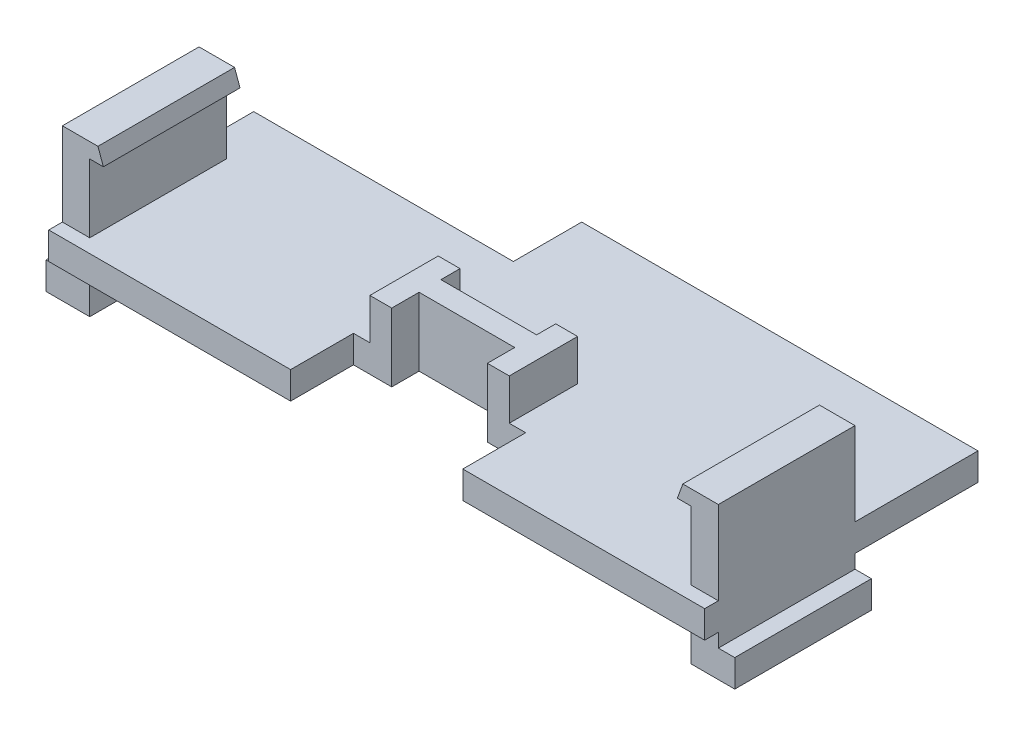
ISO-10303-21;
HEADER;
FILE_DESCRIPTION(('STEP AP214'),'2;1');
FILE_NAME('part.step','',(''),(''),'','','');
FILE_SCHEMA(('AUTOMOTIVE_DESIGN { 1 0 10303 214 1 1 1 1 }'));
ENDSEC;
DATA;
#1=APPLICATION_CONTEXT('core data for automotive mechanical design processes');
#2=APPLICATION_PROTOCOL_DEFINITION('international standard','automotive_design',2000,#1);
#3=PRODUCT_CONTEXT('',#1,'mechanical');
#4=PRODUCT('Part','Part','',(#3));
#5=PRODUCT_RELATED_PRODUCT_CATEGORY('part','',(#4));
#6=PRODUCT_DEFINITION_FORMATION('','',#4);
#7=PRODUCT_DEFINITION_CONTEXT('part definition',#1,'design');
#8=PRODUCT_DEFINITION('design','',#6,#7);
#9=PRODUCT_DEFINITION_SHAPE('','',#8);
#10=(LENGTH_UNIT() NAMED_UNIT(*) SI_UNIT(.MILLI.,.METRE.));
#11=(NAMED_UNIT(*) PLANE_ANGLE_UNIT() SI_UNIT($,.RADIAN.));
#12=(NAMED_UNIT(*) SI_UNIT($,.STERADIAN.) SOLID_ANGLE_UNIT());
#13=UNCERTAINTY_MEASURE_WITH_UNIT(LENGTH_MEASURE(1.E-05),#10,'distance_accuracy_value','');
#14=(GEOMETRIC_REPRESENTATION_CONTEXT(3) GLOBAL_UNCERTAINTY_ASSIGNED_CONTEXT((#13)) GLOBAL_UNIT_ASSIGNED_CONTEXT((#10,
#11,#12)) REPRESENTATION_CONTEXT('',''));
#15=CARTESIAN_POINT('',(0.,0.,0.));
#16=DIRECTION('',(0.,0.,1.));
#17=DIRECTION('',(1.,0.,0.));
#18=AXIS2_PLACEMENT_3D('',#15,#16,#17);
#19=CARTESIAN_POINT('',(0.,0.,0.));
#20=DIRECTION('',(0.,1.,0.));
#21=DIRECTION('',(0.,0.,1.));
#22=AXIS2_PLACEMENT_3D('',#19,#20,#21);
#23=PLANE('',#22);
#24=DIRECTION('',(-1.,0.,0.));
#25=VECTOR('',#24,1.);
#26=CARTESIAN_POINT('',(-11.,0.,-4.5));
#27=LINE('',#26,#25);
#28=CARTESIAN_POINT('',(-11.,0.,-4.5));
#29=VERTEX_POINT('',#28);
#30=CARTESIAN_POINT('',(-12.,0.,-4.5));
#31=VERTEX_POINT('',#30);
#32=EDGE_CURVE('E402',#29,#31,#27,.T.);
#33=ORIENTED_EDGE('',*,*,#32,.T.);
#34=DIRECTION('',(0.,0.,1.));
#35=VECTOR('',#34,1.);
#36=CARTESIAN_POINT('',(-12.,0.,-9.));
#37=LINE('',#36,#35);
#38=CARTESIAN_POINT('',(-12.,0.,-6.5));
#39=VERTEX_POINT('',#38);
#40=EDGE_CURVE('E677',#39,#31,#37,.T.);
#41=ORIENTED_EDGE('',*,*,#40,.F.);
#42=DIRECTION('',(-1.,0.,0.));
#43=VECTOR('',#42,1.);
#44=CARTESIAN_POINT('',(-12.,0.,-6.5));
#45=LINE('',#44,#43);
#46=CARTESIAN_POINT('',(-2.5,0.,-6.5));
#47=VERTEX_POINT('',#46);
#48=EDGE_CURVE('E605',#47,#39,#45,.T.);
#49=ORIENTED_EDGE('',*,*,#48,.F.);
#50=DIRECTION('',(0.,0.,1.));
#51=VECTOR('',#50,1.);
#52=CARTESIAN_POINT('',(-2.5,0.,-9.));
#53=LINE('',#52,#51);
#54=CARTESIAN_POINT('',(-2.5,0.,-9.));
#55=VERTEX_POINT('',#54);
#56=EDGE_CURVE('E593',#55,#47,#53,.T.);
#57=ORIENTED_EDGE('',*,*,#56,.F.);
#58=DIRECTION('',(-1.,0.,0.));
#59=VECTOR('',#58,1.);
#60=CARTESIAN_POINT('',(-12.,0.,-9.));
#61=LINE('',#60,#59);
#62=CARTESIAN_POINT('',(12.,0.,-9.));
#63=VERTEX_POINT('',#62);
#64=EDGE_CURVE('E673',#63,#55,#61,.T.);
#65=ORIENTED_EDGE('',*,*,#64,.F.);
#66=DIRECTION('',(0.,0.,-1.));
#67=VECTOR('',#66,1.);
#68=CARTESIAN_POINT('',(12.,0.,-9.));
#69=LINE('',#68,#67);
#70=CARTESIAN_POINT('',(12.,0.,-4.5));
#71=VERTEX_POINT('',#70);
#72=EDGE_CURVE('E610',#71,#63,#69,.T.);
#73=ORIENTED_EDGE('',*,*,#72,.F.);
#74=DIRECTION('',(-1.,0.,0.));
#75=VECTOR('',#74,1.);
#76=CARTESIAN_POINT('',(11.,0.,-4.5));
#77=LINE('',#76,#75);
#78=CARTESIAN_POINT('',(11.,0.,-4.5));
#79=VERTEX_POINT('',#78);
#80=EDGE_CURVE('E452',#71,#79,#77,.T.);
#81=ORIENTED_EDGE('',*,*,#80,.T.);
#82=DIRECTION('',(0.,0.,1.));
#83=VECTOR('',#82,1.);
#84=CARTESIAN_POINT('',(11.,0.,-4.5));
#85=LINE('',#84,#83);
#86=CARTESIAN_POINT('',(11.,0.,0.5));
#87=VERTEX_POINT('',#86);
#88=EDGE_CURVE('E427',#79,#87,#85,.T.);
#89=ORIENTED_EDGE('',*,*,#88,.T.);
#90=DIRECTION('',(-1.,0.,0.));
#91=VECTOR('',#90,1.);
#92=CARTESIAN_POINT('',(11.,0.,0.5));
#93=LINE('',#92,#91);
#94=CARTESIAN_POINT('',(12.,0.,0.5));
#95=VERTEX_POINT('',#94);
#96=EDGE_CURVE('E469',#95,#87,#93,.T.);
#97=ORIENTED_EDGE('',*,*,#96,.F.);
#98=CARTESIAN_POINT('',(12.,0.,1.));
#99=VERTEX_POINT('',#98);
#100=EDGE_CURVE('E670',#99,#95,#69,.T.);
#101=ORIENTED_EDGE('',*,*,#100,.F.);
#102=DIRECTION('',(1.,0.,0.));
#103=VECTOR('',#102,1.);
#104=CARTESIAN_POINT('',(-12.,0.,1.));
#105=LINE('',#104,#103);
#106=CARTESIAN_POINT('',(3.15,0.,1.));
#107=VERTEX_POINT('',#106);
#108=EDGE_CURVE('E680',#107,#99,#105,.T.);
#109=ORIENTED_EDGE('',*,*,#108,.F.);
#110=DIRECTION('',(0.,0.,1.));
#111=VECTOR('',#110,1.);
#112=CARTESIAN_POINT('',(3.15,0.,1.));
#113=LINE('',#112,#111);
#114=CARTESIAN_POINT('',(3.15,0.,-1.3));
#115=VERTEX_POINT('',#114);
#116=EDGE_CURVE('E592',#115,#107,#113,.T.);
#117=ORIENTED_EDGE('',*,*,#116,.F.);
#118=DIRECTION('',(1.,0.,0.));
#119=VECTOR('',#118,1.);
#120=CARTESIAN_POINT('',(3.15,0.,-1.3));
#121=LINE('',#120,#119);
#122=CARTESIAN_POINT('',(1.75,0.,-1.3));
#123=VERTEX_POINT('',#122);
#124=EDGE_CURVE('E596',#123,#115,#121,.T.);
#125=ORIENTED_EDGE('',*,*,#124,.F.);
#126=DIRECTION('',(0.,0.,1.));
#127=VECTOR('',#126,1.);
#128=CARTESIAN_POINT('',(1.75,0.,-1.3));
#129=LINE('',#128,#127);
#130=CARTESIAN_POINT('',(1.75,0.,-2.3));
#131=VERTEX_POINT('',#130);
#132=EDGE_CURVE('E652',#131,#123,#129,.T.);
#133=ORIENTED_EDGE('',*,*,#132,.F.);
#134=DIRECTION('',(1.,0.,0.));
#135=VECTOR('',#134,1.);
#136=CARTESIAN_POINT('',(-1.75,0.,-2.3));
#137=LINE('',#136,#135);
#138=CARTESIAN_POINT('',(-1.75,0.,-2.3));
#139=VERTEX_POINT('',#138);
#140=EDGE_CURVE('E649',#139,#131,#137,.T.);
#141=ORIENTED_EDGE('',*,*,#140,.F.);
#142=DIRECTION('',(0.,0.,-1.));
#143=VECTOR('',#142,1.);
#144=CARTESIAN_POINT('',(-1.75,0.,-1.3));
#145=LINE('',#144,#143);
#146=CARTESIAN_POINT('',(-1.75,0.,-1.3));
#147=VERTEX_POINT('',#146);
#148=EDGE_CURVE('E646',#147,#139,#145,.T.);
#149=ORIENTED_EDGE('',*,*,#148,.F.);
#150=DIRECTION('',(1.,0.,0.));
#151=VECTOR('',#150,1.);
#152=CARTESIAN_POINT('',(-3.15,0.,-1.3));
#153=LINE('',#152,#151);
#154=CARTESIAN_POINT('',(-3.15,0.,-1.3));
#155=VERTEX_POINT('',#154);
#156=EDGE_CURVE('E643',#155,#147,#153,.T.);
#157=ORIENTED_EDGE('',*,*,#156,.F.);
#158=DIRECTION('',(0.,0.,-1.));
#159=VECTOR('',#158,1.);
#160=CARTESIAN_POINT('',(-3.15,0.,1.));
#161=LINE('',#160,#159);
#162=CARTESIAN_POINT('',(-3.15,0.,1.));
#163=VERTEX_POINT('',#162);
#164=EDGE_CURVE('E640',#163,#155,#161,.T.);
#165=ORIENTED_EDGE('',*,*,#164,.F.);
#166=CARTESIAN_POINT('',(-12.,0.,1.));
#167=VERTEX_POINT('',#166);
#168=EDGE_CURVE('E681',#167,#163,#105,.T.);
#169=ORIENTED_EDGE('',*,*,#168,.F.);
#170=CARTESIAN_POINT('',(-12.,0.,0.5));
#171=VERTEX_POINT('',#170);
#172=EDGE_CURVE('E676',#171,#167,#37,.T.);
#173=ORIENTED_EDGE('',*,*,#172,.F.);
#174=DIRECTION('',(-1.,0.,0.));
#175=VECTOR('',#174,1.);
#176=CARTESIAN_POINT('',(-11.,0.,0.5));
#177=LINE('',#176,#175);
#178=CARTESIAN_POINT('',(-11.,0.,0.5));
#179=VERTEX_POINT('',#178);
#180=EDGE_CURVE('E420',#179,#171,#177,.T.);
#181=ORIENTED_EDGE('',*,*,#180,.F.);
#182=DIRECTION('',(0.,0.,1.));
#183=VECTOR('',#182,1.);
#184=CARTESIAN_POINT('',(-11.,0.,-4.5));
#185=LINE('',#184,#183);
#186=EDGE_CURVE('E381',#29,#179,#185,.T.);
#187=ORIENTED_EDGE('',*,*,#186,.F.);
#188=EDGE_LOOP('',(#33,#41,#49,#57,#65,#73,#81,#89,#97,#101,#109,#117,#125,#133,#141,#149,#157,
#165,#169,#173,#181,#187));
#189=FACE_BOUND('',#188,.T.);
#190=ADVANCED_FACE('F41',(#189),#23,.F.);
#191=CARTESIAN_POINT('',(0.,1.,0.));
#192=DIRECTION('',(0.,1.,0.));
#193=DIRECTION('',(0.,0.,1.));
#194=AXIS2_PLACEMENT_3D('',#191,#192,#193);
#195=PLANE('',#194);
#196=DIRECTION('',(1.,0.,0.));
#197=VECTOR('',#196,1.);
#198=CARTESIAN_POINT('',(-11.,1.,-4.5));
#199=LINE('',#198,#197);
#200=CARTESIAN_POINT('',(-12.,1.,-4.5));
#201=VERTEX_POINT('',#200);
#202=CARTESIAN_POINT('',(-11.,1.,-4.5));
#203=VERTEX_POINT('',#202);
#204=EDGE_CURVE('E56',#201,#203,#199,.T.);
#205=ORIENTED_EDGE('',*,*,#204,.T.);
#206=DIRECTION('',(0.,0.,1.));
#207=VECTOR('',#206,1.);
#208=CARTESIAN_POINT('',(-11.,1.,-4.5));
#209=LINE('',#208,#207);
#210=CARTESIAN_POINT('',(-11.,1.,0.5));
#211=VERTEX_POINT('',#210);
#212=EDGE_CURVE('E60',#203,#211,#209,.T.);
#213=ORIENTED_EDGE('',*,*,#212,.T.);
#214=DIRECTION('',(1.,0.,0.));
#215=VECTOR('',#214,1.);
#216=CARTESIAN_POINT('',(-11.,1.,0.5));
#217=LINE('',#216,#215);
#218=CARTESIAN_POINT('',(-12.,1.,0.5));
#219=VERTEX_POINT('',#218);
#220=EDGE_CURVE('E366',#219,#211,#217,.T.);
#221=ORIENTED_EDGE('',*,*,#220,.F.);
#222=DIRECTION('',(0.,0.,1.));
#223=VECTOR('',#222,1.);
#224=CARTESIAN_POINT('',(-12.,1.,-9.));
#225=LINE('',#224,#223);
#226=CARTESIAN_POINT('',(-12.,1.,1.));
#227=VERTEX_POINT('',#226);
#228=EDGE_CURVE('E662',#219,#227,#225,.T.);
#229=ORIENTED_EDGE('',*,*,#228,.T.);
#230=DIRECTION('',(1.,0.,0.));
#231=VECTOR('',#230,1.);
#232=CARTESIAN_POINT('',(-12.,1.,1.));
#233=LINE('',#232,#231);
#234=CARTESIAN_POINT('',(-3.15,1.,1.));
#235=VERTEX_POINT('',#234);
#236=EDGE_CURVE('E666',#227,#235,#233,.T.);
#237=ORIENTED_EDGE('',*,*,#236,.T.);
#238=DIRECTION('',(0.,0.,1.));
#239=VECTOR('',#238,1.);
#240=CARTESIAN_POINT('',(-3.15,1.,1.));
#241=LINE('',#240,#239);
#242=CARTESIAN_POINT('',(-3.15,1.,-1.3));
#243=VERTEX_POINT('',#242);
#244=EDGE_CURVE('E615',#243,#235,#241,.T.);
#245=ORIENTED_EDGE('',*,*,#244,.F.);
#246=DIRECTION('',(-1.,0.,0.));
#247=VECTOR('',#246,1.);
#248=CARTESIAN_POINT('',(-3.15,1.,-1.3));
#249=LINE('',#248,#247);
#250=CARTESIAN_POINT('',(-2.55,1.,-1.3));
#251=VERTEX_POINT('',#250);
#252=EDGE_CURVE('E632',#251,#243,#249,.T.);
#253=ORIENTED_EDGE('',*,*,#252,.F.);
#254=DIRECTION('',(0.,0.,1.));
#255=VECTOR('',#254,1.);
#256=CARTESIAN_POINT('',(-2.55,1.,-3.8));
#257=LINE('',#256,#255);
#258=CARTESIAN_POINT('',(-2.55,1.,-3.8));
#259=VERTEX_POINT('',#258);
#260=EDGE_CURVE('E552',#259,#251,#257,.T.);
#261=ORIENTED_EDGE('',*,*,#260,.F.);
#262=DIRECTION('',(-1.,0.,0.));
#263=VECTOR('',#262,1.);
#264=CARTESIAN_POINT('',(-2.55,1.,-3.8));
#265=LINE('',#264,#263);
#266=CARTESIAN_POINT('',(-1.75,1.,-3.8));
#267=VERTEX_POINT('',#266);
#268=EDGE_CURVE('E511',#267,#259,#265,.T.);
#269=ORIENTED_EDGE('',*,*,#268,.F.);
#270=DIRECTION('',(0.,0.,-1.));
#271=VECTOR('',#270,1.);
#272=CARTESIAN_POINT('',(-1.75,1.,-3.8));
#273=LINE('',#272,#271);
#274=CARTESIAN_POINT('',(-1.75,1.,-3.09999999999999));
#275=VERTEX_POINT('',#274);
#276=EDGE_CURVE('E523',#275,#267,#273,.T.);
#277=ORIENTED_EDGE('',*,*,#276,.F.);
#278=DIRECTION('',(-1.,0.,0.));
#279=VECTOR('',#278,1.);
#280=CARTESIAN_POINT('',(-1.75,1.,-3.09999999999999));
#281=LINE('',#280,#279);
#282=CARTESIAN_POINT('',(1.75,1.,-3.09999999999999));
#283=VERTEX_POINT('',#282);
#284=EDGE_CURVE('E564',#283,#275,#281,.T.);
#285=ORIENTED_EDGE('',*,*,#284,.F.);
#286=DIRECTION('',(0.,0.,1.));
#287=VECTOR('',#286,1.);
#288=CARTESIAN_POINT('',(1.75,1.,-3.8));
#289=LINE('',#288,#287);
#290=CARTESIAN_POINT('',(1.75,1.,-3.8));
#291=VERTEX_POINT('',#290);
#292=EDGE_CURVE('E561',#291,#283,#289,.T.);
#293=ORIENTED_EDGE('',*,*,#292,.F.);
#294=DIRECTION('',(-1.,0.,0.));
#295=VECTOR('',#294,1.);
#296=CARTESIAN_POINT('',(2.55,1.,-3.8));
#297=LINE('',#296,#295);
#298=CARTESIAN_POINT('',(2.55,1.,-3.8));
#299=VERTEX_POINT('',#298);
#300=EDGE_CURVE('E558',#299,#291,#297,.T.);
#301=ORIENTED_EDGE('',*,*,#300,.F.);
#302=DIRECTION('',(0.,0.,-1.));
#303=VECTOR('',#302,1.);
#304=CARTESIAN_POINT('',(2.55,1.,-3.8));
#305=LINE('',#304,#303);
#306=CARTESIAN_POINT('',(2.55,1.,-1.3));
#307=VERTEX_POINT('',#306);
#308=EDGE_CURVE('E555',#307,#299,#305,.T.);
#309=ORIENTED_EDGE('',*,*,#308,.F.);
#310=DIRECTION('',(-1.,0.,0.));
#311=VECTOR('',#310,1.);
#312=CARTESIAN_POINT('',(3.15,1.,-1.3));
#313=LINE('',#312,#311);
#314=CARTESIAN_POINT('',(3.15,1.,-1.3));
#315=VERTEX_POINT('',#314);
#316=EDGE_CURVE('E634',#315,#307,#313,.T.);
#317=ORIENTED_EDGE('',*,*,#316,.F.);
#318=DIRECTION('',(0.,0.,-1.));
#319=VECTOR('',#318,1.);
#320=CARTESIAN_POINT('',(3.15,1.,1.));
#321=LINE('',#320,#319);
#322=CARTESIAN_POINT('',(3.15,1.,1.));
#323=VERTEX_POINT('',#322);
#324=EDGE_CURVE('E637',#323,#315,#321,.T.);
#325=ORIENTED_EDGE('',*,*,#324,.F.);
#326=CARTESIAN_POINT('',(12.,1.,1.));
#327=VERTEX_POINT('',#326);
#328=EDGE_CURVE('E665',#323,#327,#233,.T.);
#329=ORIENTED_EDGE('',*,*,#328,.T.);
#330=DIRECTION('',(0.,0.,-1.));
#331=VECTOR('',#330,1.);
#332=CARTESIAN_POINT('',(12.,1.,-9.));
#333=LINE('',#332,#331);
#334=CARTESIAN_POINT('',(12.,1.,0.5));
#335=VERTEX_POINT('',#334);
#336=EDGE_CURVE('E656',#327,#335,#333,.T.);
#337=ORIENTED_EDGE('',*,*,#336,.T.);
#338=DIRECTION('',(1.,0.,0.));
#339=VECTOR('',#338,1.);
#340=CARTESIAN_POINT('',(11.,1.,0.5));
#341=LINE('',#340,#339);
#342=CARTESIAN_POINT('',(11.,1.,0.5));
#343=VERTEX_POINT('',#342);
#344=EDGE_CURVE('E472',#343,#335,#341,.T.);
#345=ORIENTED_EDGE('',*,*,#344,.F.);
#346=DIRECTION('',(0.,0.,1.));
#347=VECTOR('',#346,1.);
#348=CARTESIAN_POINT('',(11.,1.,-4.5));
#349=LINE('',#348,#347);
#350=CARTESIAN_POINT('',(11.,1.,-4.5));
#351=VERTEX_POINT('',#350);
#352=EDGE_CURVE('E508',#351,#343,#349,.T.);
#353=ORIENTED_EDGE('',*,*,#352,.F.);
#354=DIRECTION('',(1.,0.,0.));
#355=VECTOR('',#354,1.);
#356=CARTESIAN_POINT('',(11.,1.,-4.5));
#357=LINE('',#356,#355);
#358=CARTESIAN_POINT('',(12.,1.,-4.5));
#359=VERTEX_POINT('',#358);
#360=EDGE_CURVE('E490',#351,#359,#357,.T.);
#361=ORIENTED_EDGE('',*,*,#360,.T.);
#362=CARTESIAN_POINT('',(12.,1.,-9.));
#363=VERTEX_POINT('',#362);
#364=EDGE_CURVE('E659',#359,#363,#333,.T.);
#365=ORIENTED_EDGE('',*,*,#364,.T.);
#366=DIRECTION('',(-1.,0.,0.));
#367=VECTOR('',#366,1.);
#368=CARTESIAN_POINT('',(-12.,1.,-9.));
#369=LINE('',#368,#367);
#370=CARTESIAN_POINT('',(-2.5,1.,-9.));
#371=VERTEX_POINT('',#370);
#372=EDGE_CURVE('E658',#363,#371,#369,.T.);
#373=ORIENTED_EDGE('',*,*,#372,.T.);
#374=DIRECTION('',(0.,0.,-1.));
#375=VECTOR('',#374,1.);
#376=CARTESIAN_POINT('',(-2.5,1.,-9.));
#377=LINE('',#376,#375);
#378=CARTESIAN_POINT('',(-2.5,1.,-6.5));
#379=VERTEX_POINT('',#378);
#380=EDGE_CURVE('E599',#379,#371,#377,.T.);
#381=ORIENTED_EDGE('',*,*,#380,.F.);
#382=DIRECTION('',(1.,0.,0.));
#383=VECTOR('',#382,1.);
#384=CARTESIAN_POINT('',(-12.,1.,-6.5));
#385=LINE('',#384,#383);
#386=CARTESIAN_POINT('',(-12.,1.,-6.5));
#387=VERTEX_POINT('',#386);
#388=EDGE_CURVE('E595',#387,#379,#385,.T.);
#389=ORIENTED_EDGE('',*,*,#388,.F.);
#390=EDGE_CURVE('E663',#387,#201,#225,.T.);
#391=ORIENTED_EDGE('',*,*,#390,.T.);
#392=EDGE_LOOP('',(#205,#213,#221,#229,#237,#245,#253,#261,#269,#277,#285,#293,#301,#309,#317,
#325,#329,#337,#345,#353,#361,#365,#373,#381,#389,#391));
#393=FACE_BOUND('',#392,.T.);
#394=ADVANCED_FACE('F700',(#393),#195,.T.);
#395=CARTESIAN_POINT('',(-12.,1.,1.));
#396=DIRECTION('',(0.,0.,-1.));
#397=DIRECTION('',(-1.,0.,0.));
#398=AXIS2_PLACEMENT_3D('',#395,#396,#397);
#399=PLANE('',#398);
#400=ORIENTED_EDGE('',*,*,#168,.T.);
#401=DIRECTION('',(0.,1.,0.));
#402=VECTOR('',#401,1.);
#403=CARTESIAN_POINT('',(-3.15,-0.000999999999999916,1.));
#404=LINE('',#403,#402);
#405=EDGE_CURVE('E612',#163,#235,#404,.T.);
#406=ORIENTED_EDGE('',*,*,#405,.T.);
#407=ORIENTED_EDGE('',*,*,#236,.F.);
#408=DIRECTION('',(0.,-1.,0.));
#409=VECTOR('',#408,1.);
#410=CARTESIAN_POINT('',(-12.,1.,1.));
#411=LINE('',#410,#409);
#412=EDGE_CURVE('E49',#227,#167,#411,.T.);
#413=ORIENTED_EDGE('',*,*,#412,.T.);
#414=EDGE_LOOP('',(#400,#406,#407,#413));
#415=FACE_BOUND('',#414,.T.);
#416=ADVANCED_FACE('F690',(#415),#399,.F.);
#417=CARTESIAN_POINT('',(12.,1.,-9.));
#418=DIRECTION('',(-1.,0.,0.));
#419=DIRECTION('',(0.,0.,1.));
#420=AXIS2_PLACEMENT_3D('',#417,#418,#419);
#421=PLANE('',#420);
#422=ORIENTED_EDGE('',*,*,#100,.T.);
#423=DIRECTION('',(0.,1.,0.));
#424=VECTOR('',#423,1.);
#425=CARTESIAN_POINT('',(12.,0.,0.5));
#426=LINE('',#425,#424);
#427=CARTESIAN_POINT('',(12.,-0.5,0.5));
#428=VERTEX_POINT('',#427);
#429=EDGE_CURVE('E455',#428,#95,#426,.T.);
#430=ORIENTED_EDGE('',*,*,#429,.F.);
#431=DIRECTION('',(0.,0.,1.));
#432=VECTOR('',#431,1.);
#433=CARTESIAN_POINT('',(12.,-0.5,-4.5));
#434=LINE('',#433,#432);
#435=CARTESIAN_POINT('',(12.,-0.5,-4.5));
#436=VERTEX_POINT('',#435);
#437=EDGE_CURVE('E426',#436,#428,#434,.T.);
#438=ORIENTED_EDGE('',*,*,#437,.F.);
#439=DIRECTION('',(0.,1.,0.));
#440=VECTOR('',#439,1.);
#441=CARTESIAN_POINT('',(12.,0.,-4.5));
#442=LINE('',#441,#440);
#443=EDGE_CURVE('E430',#436,#71,#442,.T.);
#444=ORIENTED_EDGE('',*,*,#443,.T.);
#445=ORIENTED_EDGE('',*,*,#72,.T.);
#446=DIRECTION('',(0.,-1.,0.));
#447=VECTOR('',#446,1.);
#448=CARTESIAN_POINT('',(12.,1.,-9.));
#449=LINE('',#448,#447);
#450=EDGE_CURVE('E11',#363,#63,#449,.T.);
#451=ORIENTED_EDGE('',*,*,#450,.F.);
#452=ORIENTED_EDGE('',*,*,#364,.F.);
#453=DIRECTION('',(0.,1.,0.));
#454=VECTOR('',#453,1.);
#455=CARTESIAN_POINT('',(12.,1.,-4.5));
#456=LINE('',#455,#454);
#457=CARTESIAN_POINT('',(12.,4.05068048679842,-4.5));
#458=VERTEX_POINT('',#457);
#459=EDGE_CURVE('E492',#359,#458,#456,.T.);
#460=ORIENTED_EDGE('',*,*,#459,.T.);
#461=DIRECTION('',(0.,0.,1.));
#462=VECTOR('',#461,1.);
#463=CARTESIAN_POINT('',(12.,4.05068048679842,-4.5));
#464=LINE('',#463,#462);
#465=CARTESIAN_POINT('',(12.,4.05068048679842,0.5));
#466=VERTEX_POINT('',#465);
#467=EDGE_CURVE('E507',#458,#466,#464,.T.);
#468=ORIENTED_EDGE('',*,*,#467,.T.);
#469=DIRECTION('',(0.,1.,0.));
#470=VECTOR('',#469,1.);
#471=CARTESIAN_POINT('',(12.,1.,0.5));
#472=LINE('',#471,#470);
#473=EDGE_CURVE('E475',#335,#466,#472,.T.);
#474=ORIENTED_EDGE('',*,*,#473,.F.);
#475=ORIENTED_EDGE('',*,*,#336,.F.);
#476=DIRECTION('',(0.,-1.,0.));
#477=VECTOR('',#476,1.);
#478=CARTESIAN_POINT('',(12.,1.,1.));
#479=LINE('',#478,#477);
#480=EDGE_CURVE('E669',#327,#99,#479,.T.);
#481=ORIENTED_EDGE('',*,*,#480,.T.);
#482=EDGE_LOOP('',(#422,#430,#438,#444,#445,#451,#452,#460,#468,#474,#475,#481));
#483=FACE_BOUND('',#482,.T.);
#484=ADVANCED_FACE('F43',(#483),#421,.F.);
#485=CARTESIAN_POINT('',(-12.,1.,-9.));
#486=DIRECTION('',(0.,0.,1.));
#487=DIRECTION('',(1.,0.,0.));
#488=AXIS2_PLACEMENT_3D('',#485,#486,#487);
#489=PLANE('',#488);
#490=ORIENTED_EDGE('',*,*,#64,.T.);
#491=DIRECTION('',(0.,1.,0.));
#492=VECTOR('',#491,1.);
#493=CARTESIAN_POINT('',(-2.5,-0.000999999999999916,-9.));
#494=LINE('',#493,#492);
#495=EDGE_CURVE('E602',#55,#371,#494,.T.);
#496=ORIENTED_EDGE('',*,*,#495,.T.);
#497=ORIENTED_EDGE('',*,*,#372,.F.);
#498=ORIENTED_EDGE('',*,*,#450,.T.);
#499=EDGE_LOOP('',(#490,#496,#497,#498));
#500=FACE_BOUND('',#499,.T.);
#501=ADVANCED_FACE('F742',(#500),#489,.F.);
#502=CARTESIAN_POINT('',(-12.,1.,-9.));
#503=DIRECTION('',(1.,0.,0.));
#504=DIRECTION('',(0.,0.,-1.));
#505=AXIS2_PLACEMENT_3D('',#502,#503,#504);
#506=PLANE('',#505);
#507=ORIENTED_EDGE('',*,*,#390,.F.);
#508=DIRECTION('',(0.,1.,0.));
#509=VECTOR('',#508,1.);
#510=CARTESIAN_POINT('',(-12.,-0.000999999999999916,-6.5));
#511=LINE('',#510,#509);
#512=EDGE_CURVE('E601',#39,#387,#511,.T.);
#513=ORIENTED_EDGE('',*,*,#512,.F.);
#514=ORIENTED_EDGE('',*,*,#40,.T.);
#515=DIRECTION('',(0.,-1.,0.));
#516=VECTOR('',#515,1.);
#517=CARTESIAN_POINT('',(-12.,0.,-4.5));
#518=LINE('',#517,#516);
#519=CARTESIAN_POINT('',(-12.,-0.5,-4.5));
#520=VERTEX_POINT('',#519);
#521=EDGE_CURVE('E399',#31,#520,#518,.T.);
#522=ORIENTED_EDGE('',*,*,#521,.T.);
#523=DIRECTION('',(0.,0.,1.));
#524=VECTOR('',#523,1.);
#525=CARTESIAN_POINT('',(-12.,-0.5,-4.5));
#526=LINE('',#525,#524);
#527=CARTESIAN_POINT('',(-12.,-0.5,0.5));
#528=VERTEX_POINT('',#527);
#529=EDGE_CURVE('E384',#520,#528,#526,.T.);
#530=ORIENTED_EDGE('',*,*,#529,.T.);
#531=DIRECTION('',(0.,-1.,0.));
#532=VECTOR('',#531,1.);
#533=CARTESIAN_POINT('',(-12.,0.,0.5));
#534=LINE('',#533,#532);
#535=EDGE_CURVE('E417',#171,#528,#534,.T.);
#536=ORIENTED_EDGE('',*,*,#535,.F.);
#537=ORIENTED_EDGE('',*,*,#172,.T.);
#538=ORIENTED_EDGE('',*,*,#412,.F.);
#539=ORIENTED_EDGE('',*,*,#228,.F.);
#540=DIRECTION('',(0.,-1.,0.));
#541=VECTOR('',#540,1.);
#542=CARTESIAN_POINT('',(-12.,1.,0.5));
#543=LINE('',#542,#541);
#544=CARTESIAN_POINT('',(-12.,4.05068048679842,0.5));
#545=VERTEX_POINT('',#544);
#546=EDGE_CURVE('E339',#545,#219,#543,.T.);
#547=ORIENTED_EDGE('',*,*,#546,.F.);
#548=DIRECTION('',(0.,0.,1.));
#549=VECTOR('',#548,1.);
#550=CARTESIAN_POINT('',(-12.,4.05068048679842,-4.5));
#551=LINE('',#550,#549);
#552=CARTESIAN_POINT('',(-12.,4.05068048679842,-4.5));
#553=VERTEX_POINT('',#552);
#554=EDGE_CURVE('E333',#553,#545,#551,.T.);
#555=ORIENTED_EDGE('',*,*,#554,.F.);
#556=DIRECTION('',(0.,-1.,0.));
#557=VECTOR('',#556,1.);
#558=CARTESIAN_POINT('',(-12.,1.,-4.5));
#559=LINE('',#558,#557);
#560=EDGE_CURVE('E337',#553,#201,#559,.T.);
#561=ORIENTED_EDGE('',*,*,#560,.T.);
#562=EDGE_LOOP('',(#507,#513,#514,#522,#530,#536,#537,#538,#539,#547,#555,#561));
#563=FACE_BOUND('',#562,.T.);
#564=ADVANCED_FACE('F336',(#563),#506,.F.);
#565=ORIENTED_EDGE('',*,*,#328,.F.);
#566=DIRECTION('',(0.,1.,0.));
#567=VECTOR('',#566,1.);
#568=CARTESIAN_POINT('',(3.15,-0.000999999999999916,1.));
#569=LINE('',#568,#567);
#570=EDGE_CURVE('E613',#107,#323,#569,.T.);
#571=ORIENTED_EDGE('',*,*,#570,.F.);
#572=ORIENTED_EDGE('',*,*,#108,.T.);
#573=ORIENTED_EDGE('',*,*,#480,.F.);
#574=EDGE_LOOP('',(#565,#571,#572,#573));
#575=FACE_BOUND('',#574,.T.);
#576=ADVANCED_FACE('F737',(#575),#399,.F.);
#577=CARTESIAN_POINT('',(-3.15,-0.000999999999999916,1.));
#578=DIRECTION('',(-1.,0.,0.));
#579=DIRECTION('',(0.,0.,1.));
#580=AXIS2_PLACEMENT_3D('',#577,#578,#579);
#581=PLANE('',#580);
#582=ORIENTED_EDGE('',*,*,#164,.T.);
#583=DIRECTION('',(0.,1.,0.));
#584=VECTOR('',#583,1.);
#585=CARTESIAN_POINT('',(-3.15,-0.000999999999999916,-1.3));
#586=LINE('',#585,#584);
#587=EDGE_CURVE('E626',#155,#243,#586,.T.);
#588=ORIENTED_EDGE('',*,*,#587,.T.);
#589=ORIENTED_EDGE('',*,*,#244,.T.);
#590=ORIENTED_EDGE('',*,*,#405,.F.);
#591=EDGE_LOOP('',(#582,#588,#589,#590));
#592=FACE_BOUND('',#591,.T.);
#593=ADVANCED_FACE('F698',(#592),#581,.F.);
#594=CARTESIAN_POINT('',(-3.15,-0.000999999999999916,-1.3));
#595=DIRECTION('',(0.,0.,-1.));
#596=DIRECTION('',(-1.,0.,0.));
#597=AXIS2_PLACEMENT_3D('',#594,#595,#596);
#598=PLANE('',#597);
#599=ORIENTED_EDGE('',*,*,#156,.T.);
#600=DIRECTION('',(0.,1.,0.));
#601=VECTOR('',#600,1.);
#602=CARTESIAN_POINT('',(-1.75,-0.000999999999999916,-1.3));
#603=LINE('',#602,#601);
#604=CARTESIAN_POINT('',(-1.75,2.5,-1.3));
#605=VERTEX_POINT('',#604);
#606=EDGE_CURVE('E624',#147,#605,#603,.T.);
#607=ORIENTED_EDGE('',*,*,#606,.T.);
#608=DIRECTION('',(1.,0.,0.));
#609=VECTOR('',#608,1.);
#610=CARTESIAN_POINT('',(-2.55,2.5,-1.3));
#611=LINE('',#610,#609);
#612=CARTESIAN_POINT('',(-2.55,2.5,-1.3));
#613=VERTEX_POINT('',#612);
#614=EDGE_CURVE('E525',#613,#605,#611,.T.);
#615=ORIENTED_EDGE('',*,*,#614,.F.);
#616=DIRECTION('',(0.,-1.,0.));
#617=VECTOR('',#616,1.);
#618=CARTESIAN_POINT('',(-2.55,2.5,-1.3));
#619=LINE('',#618,#617);
#620=EDGE_CURVE('E586',#613,#251,#619,.T.);
#621=ORIENTED_EDGE('',*,*,#620,.T.);
#622=ORIENTED_EDGE('',*,*,#252,.T.);
#623=ORIENTED_EDGE('',*,*,#587,.F.);
#624=EDGE_LOOP('',(#599,#607,#615,#621,#622,#623));
#625=FACE_BOUND('',#624,.T.);
#626=ADVANCED_FACE('F820',(#625),#598,.F.);
#627=CARTESIAN_POINT('',(-1.75,-0.000999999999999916,-1.3));
#628=DIRECTION('',(-1.,0.,0.));
#629=DIRECTION('',(0.,0.,1.));
#630=AXIS2_PLACEMENT_3D('',#627,#628,#629);
#631=PLANE('',#630);
#632=ORIENTED_EDGE('',*,*,#148,.T.);
#633=DIRECTION('',(0.,1.,0.));
#634=VECTOR('',#633,1.);
#635=CARTESIAN_POINT('',(-1.75,-0.000999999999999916,-2.3));
#636=LINE('',#635,#634);
#637=CARTESIAN_POINT('',(-1.75,2.5,-2.3));
#638=VERTEX_POINT('',#637);
#639=EDGE_CURVE('E622',#139,#638,#636,.T.);
#640=ORIENTED_EDGE('',*,*,#639,.T.);
#641=DIRECTION('',(0.,0.,-1.));
#642=VECTOR('',#641,1.);
#643=CARTESIAN_POINT('',(-1.75,2.5,-1.3));
#644=LINE('',#643,#642);
#645=EDGE_CURVE('E528',#605,#638,#644,.T.);
#646=ORIENTED_EDGE('',*,*,#645,.F.);
#647=ORIENTED_EDGE('',*,*,#606,.F.);
#648=EDGE_LOOP('',(#632,#640,#646,#647));
#649=FACE_BOUND('',#648,.T.);
#650=ADVANCED_FACE('F817',(#649),#631,.F.);
#651=CARTESIAN_POINT('',(-1.75,-0.000999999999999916,-2.3));
#652=DIRECTION('',(0.,0.,-1.));
#653=DIRECTION('',(-1.,0.,0.));
#654=AXIS2_PLACEMENT_3D('',#651,#652,#653);
#655=PLANE('',#654);
#656=ORIENTED_EDGE('',*,*,#140,.T.);
#657=DIRECTION('',(0.,1.,0.));
#658=VECTOR('',#657,1.);
#659=CARTESIAN_POINT('',(1.75,-0.000999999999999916,-2.3));
#660=LINE('',#659,#658);
#661=CARTESIAN_POINT('',(1.75,2.5,-2.3));
#662=VERTEX_POINT('',#661);
#663=EDGE_CURVE('E620',#131,#662,#660,.T.);
#664=ORIENTED_EDGE('',*,*,#663,.T.);
#665=DIRECTION('',(1.,0.,0.));
#666=VECTOR('',#665,1.);
#667=CARTESIAN_POINT('',(-1.75,2.5,-2.3));
#668=LINE('',#667,#666);
#669=EDGE_CURVE('E531',#638,#662,#668,.T.);
#670=ORIENTED_EDGE('',*,*,#669,.F.);
#671=ORIENTED_EDGE('',*,*,#639,.F.);
#672=EDGE_LOOP('',(#656,#664,#670,#671));
#673=FACE_BOUND('',#672,.T.);
#674=ADVANCED_FACE('F813',(#673),#655,.F.);
#675=CARTESIAN_POINT('',(1.75,-0.000999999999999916,-1.3));
#676=DIRECTION('',(1.,0.,0.));
#677=DIRECTION('',(0.,0.,-1.));
#678=AXIS2_PLACEMENT_3D('',#675,#676,#677);
#679=PLANE('',#678);
#680=ORIENTED_EDGE('',*,*,#132,.T.);
#681=DIRECTION('',(0.,1.,0.));
#682=VECTOR('',#681,1.);
#683=CARTESIAN_POINT('',(1.75,-0.000999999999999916,-1.3));
#684=LINE('',#683,#682);
#685=CARTESIAN_POINT('',(1.75,2.5,-1.3));
#686=VERTEX_POINT('',#685);
#687=EDGE_CURVE('E618',#123,#686,#684,.T.);
#688=ORIENTED_EDGE('',*,*,#687,.T.);
#689=DIRECTION('',(0.,0.,1.));
#690=VECTOR('',#689,1.);
#691=CARTESIAN_POINT('',(1.75,2.5,-1.3));
#692=LINE('',#691,#690);
#693=EDGE_CURVE('E534',#662,#686,#692,.T.);
#694=ORIENTED_EDGE('',*,*,#693,.F.);
#695=ORIENTED_EDGE('',*,*,#663,.F.);
#696=EDGE_LOOP('',(#680,#688,#694,#695));
#697=FACE_BOUND('',#696,.T.);
#698=ADVANCED_FACE('F810',(#697),#679,.F.);
#699=CARTESIAN_POINT('',(3.15,-0.000999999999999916,-1.3));
#700=DIRECTION('',(0.,0.,-1.));
#701=DIRECTION('',(-1.,0.,0.));
#702=AXIS2_PLACEMENT_3D('',#699,#700,#701);
#703=PLANE('',#702);
#704=ORIENTED_EDGE('',*,*,#124,.T.);
#705=DIRECTION('',(0.,1.,0.));
#706=VECTOR('',#705,1.);
#707=CARTESIAN_POINT('',(3.15,-0.000999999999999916,-1.3));
#708=LINE('',#707,#706);
#709=EDGE_CURVE('E616',#115,#315,#708,.T.);
#710=ORIENTED_EDGE('',*,*,#709,.T.);
#711=ORIENTED_EDGE('',*,*,#316,.T.);
#712=DIRECTION('',(0.,-1.,0.));
#713=VECTOR('',#712,1.);
#714=CARTESIAN_POINT('',(2.55,2.5,-1.3));
#715=LINE('',#714,#713);
#716=CARTESIAN_POINT('',(2.55,2.5,-1.3));
#717=VERTEX_POINT('',#716);
#718=EDGE_CURVE('E583',#717,#307,#715,.T.);
#719=ORIENTED_EDGE('',*,*,#718,.F.);
#720=DIRECTION('',(1.,0.,0.));
#721=VECTOR('',#720,1.);
#722=CARTESIAN_POINT('',(2.55,2.5,-1.3));
#723=LINE('',#722,#721);
#724=EDGE_CURVE('E537',#686,#717,#723,.T.);
#725=ORIENTED_EDGE('',*,*,#724,.F.);
#726=ORIENTED_EDGE('',*,*,#687,.F.);
#727=EDGE_LOOP('',(#704,#710,#711,#719,#725,#726));
#728=FACE_BOUND('',#727,.T.);
#729=ADVANCED_FACE('F797',(#728),#703,.F.);
#730=CARTESIAN_POINT('',(3.15,-0.000999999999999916,1.));
#731=DIRECTION('',(1.,0.,0.));
#732=DIRECTION('',(0.,0.,-1.));
#733=AXIS2_PLACEMENT_3D('',#730,#731,#732);
#734=PLANE('',#733);
#735=ORIENTED_EDGE('',*,*,#116,.T.);
#736=ORIENTED_EDGE('',*,*,#570,.T.);
#737=ORIENTED_EDGE('',*,*,#324,.T.);
#738=ORIENTED_EDGE('',*,*,#709,.F.);
#739=EDGE_LOOP('',(#735,#736,#737,#738));
#740=FACE_BOUND('',#739,.T.);
#741=ADVANCED_FACE('F792',(#740),#734,.F.);
#742=CARTESIAN_POINT('',(-2.5,-0.000999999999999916,-9.));
#743=DIRECTION('',(1.,0.,0.));
#744=DIRECTION('',(0.,0.,-1.));
#745=AXIS2_PLACEMENT_3D('',#742,#743,#744);
#746=PLANE('',#745);
#747=ORIENTED_EDGE('',*,*,#56,.T.);
#748=DIRECTION('',(0.,1.,0.));
#749=VECTOR('',#748,1.);
#750=CARTESIAN_POINT('',(-2.5,-0.000999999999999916,-6.5));
#751=LINE('',#750,#749);
#752=EDGE_CURVE('E606',#47,#379,#751,.T.);
#753=ORIENTED_EDGE('',*,*,#752,.T.);
#754=ORIENTED_EDGE('',*,*,#380,.T.);
#755=ORIENTED_EDGE('',*,*,#495,.F.);
#756=EDGE_LOOP('',(#747,#753,#754,#755));
#757=FACE_BOUND('',#756,.T.);
#758=ADVANCED_FACE('F759',(#757),#746,.F.);
#759=CARTESIAN_POINT('',(-12.,-0.000999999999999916,-6.5));
#760=DIRECTION('',(0.,0.,1.));
#761=DIRECTION('',(1.,0.,0.));
#762=AXIS2_PLACEMENT_3D('',#759,#760,#761);
#763=PLANE('',#762);
#764=ORIENTED_EDGE('',*,*,#48,.T.);
#765=ORIENTED_EDGE('',*,*,#512,.T.);
#766=ORIENTED_EDGE('',*,*,#388,.T.);
#767=ORIENTED_EDGE('',*,*,#752,.F.);
#768=EDGE_LOOP('',(#764,#765,#766,#767));
#769=FACE_BOUND('',#768,.T.);
#770=ADVANCED_FACE('F761',(#769),#763,.F.);
#771=CARTESIAN_POINT('',(-2.55,2.5,-3.8));
#772=DIRECTION('',(0.,0.,1.));
#773=DIRECTION('',(1.,0.,0.));
#774=AXIS2_PLACEMENT_3D('',#771,#772,#773);
#775=PLANE('',#774);
#776=ORIENTED_EDGE('',*,*,#268,.T.);
#777=DIRECTION('',(0.,-1.,0.));
#778=VECTOR('',#777,1.);
#779=CARTESIAN_POINT('',(-2.55,2.5,-3.8));
#780=LINE('',#779,#778);
#781=CARTESIAN_POINT('',(-2.55,2.5,-3.8));
#782=VERTEX_POINT('',#781);
#783=EDGE_CURVE('E589',#782,#259,#780,.T.);
#784=ORIENTED_EDGE('',*,*,#783,.F.);
#785=DIRECTION('',(-1.,0.,0.));
#786=VECTOR('',#785,1.);
#787=CARTESIAN_POINT('',(-2.55,2.5,-3.8));
#788=LINE('',#787,#786);
#789=CARTESIAN_POINT('',(-1.75,2.5,-3.8));
#790=VERTEX_POINT('',#789);
#791=EDGE_CURVE('E519',#790,#782,#788,.T.);
#792=ORIENTED_EDGE('',*,*,#791,.F.);
#793=DIRECTION('',(0.,-1.,0.));
#794=VECTOR('',#793,1.);
#795=CARTESIAN_POINT('',(-1.75,2.5,-3.8));
#796=LINE('',#795,#794);
#797=EDGE_CURVE('E549',#790,#267,#796,.T.);
#798=ORIENTED_EDGE('',*,*,#797,.T.);
#799=EDGE_LOOP('',(#776,#784,#792,#798));
#800=FACE_BOUND('',#799,.T.);
#801=ADVANCED_FACE('F827',(#800),#775,.F.);
#802=CARTESIAN_POINT('',(-2.55,2.5,-3.8));
#803=DIRECTION('',(1.,0.,0.));
#804=DIRECTION('',(0.,0.,-1.));
#805=AXIS2_PLACEMENT_3D('',#802,#803,#804);
#806=PLANE('',#805);
#807=ORIENTED_EDGE('',*,*,#260,.T.);
#808=ORIENTED_EDGE('',*,*,#620,.F.);
#809=DIRECTION('',(0.,0.,1.));
#810=VECTOR('',#809,1.);
#811=CARTESIAN_POINT('',(-2.55,2.5,-3.8));
#812=LINE('',#811,#810);
#813=EDGE_CURVE('E522',#782,#613,#812,.T.);
#814=ORIENTED_EDGE('',*,*,#813,.F.);
#815=ORIENTED_EDGE('',*,*,#783,.T.);
#816=EDGE_LOOP('',(#807,#808,#814,#815));
#817=FACE_BOUND('',#816,.T.);
#818=ADVANCED_FACE('F823',(#817),#806,.F.);
#819=CARTESIAN_POINT('',(2.55,2.5,-3.8));
#820=DIRECTION('',(-1.,0.,0.));
#821=DIRECTION('',(0.,0.,1.));
#822=AXIS2_PLACEMENT_3D('',#819,#820,#821);
#823=PLANE('',#822);
#824=ORIENTED_EDGE('',*,*,#308,.T.);
#825=DIRECTION('',(0.,-1.,0.));
#826=VECTOR('',#825,1.);
#827=CARTESIAN_POINT('',(2.55,2.5,-3.8));
#828=LINE('',#827,#826);
#829=CARTESIAN_POINT('',(2.55,2.5,-3.8));
#830=VERTEX_POINT('',#829);
#831=EDGE_CURVE('E580',#830,#299,#828,.T.);
#832=ORIENTED_EDGE('',*,*,#831,.F.);
#833=DIRECTION('',(0.,0.,-1.));
#834=VECTOR('',#833,1.);
#835=CARTESIAN_POINT('',(2.55,2.5,-3.8));
#836=LINE('',#835,#834);
#837=EDGE_CURVE('E539',#717,#830,#836,.T.);
#838=ORIENTED_EDGE('',*,*,#837,.F.);
#839=ORIENTED_EDGE('',*,*,#718,.T.);
#840=EDGE_LOOP('',(#824,#832,#838,#839));
#841=FACE_BOUND('',#840,.T.);
#842=ADVANCED_FACE('F801',(#841),#823,.F.);
#843=CARTESIAN_POINT('',(2.55,2.5,-3.8));
#844=DIRECTION('',(0.,0.,1.));
#845=DIRECTION('',(1.,0.,0.));
#846=AXIS2_PLACEMENT_3D('',#843,#844,#845);
#847=PLANE('',#846);
#848=ORIENTED_EDGE('',*,*,#300,.T.);
#849=DIRECTION('',(0.,-1.,0.));
#850=VECTOR('',#849,1.);
#851=CARTESIAN_POINT('',(1.75,2.5,-3.8));
#852=LINE('',#851,#850);
#853=CARTESIAN_POINT('',(1.75,2.5,-3.8));
#854=VERTEX_POINT('',#853);
#855=EDGE_CURVE('E577',#854,#291,#852,.T.);
#856=ORIENTED_EDGE('',*,*,#855,.F.);
#857=DIRECTION('',(-1.,0.,0.));
#858=VECTOR('',#857,1.);
#859=CARTESIAN_POINT('',(2.55,2.5,-3.8));
#860=LINE('',#859,#858);
#861=EDGE_CURVE('E541',#830,#854,#860,.T.);
#862=ORIENTED_EDGE('',*,*,#861,.F.);
#863=ORIENTED_EDGE('',*,*,#831,.T.);
#864=EDGE_LOOP('',(#848,#856,#862,#863));
#865=FACE_BOUND('',#864,.T.);
#866=ADVANCED_FACE('F841',(#865),#847,.F.);
#867=CARTESIAN_POINT('',(1.75,2.5,-3.8));
#868=DIRECTION('',(1.,0.,0.));
#869=DIRECTION('',(0.,0.,-1.));
#870=AXIS2_PLACEMENT_3D('',#867,#868,#869);
#871=PLANE('',#870);
#872=ORIENTED_EDGE('',*,*,#292,.T.);
#873=DIRECTION('',(0.,-1.,0.));
#874=VECTOR('',#873,1.);
#875=CARTESIAN_POINT('',(1.75,2.5,-3.09999999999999));
#876=LINE('',#875,#874);
#877=CARTESIAN_POINT('',(1.75,2.5,-3.09999999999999));
#878=VERTEX_POINT('',#877);
#879=EDGE_CURVE('E574',#878,#283,#876,.T.);
#880=ORIENTED_EDGE('',*,*,#879,.F.);
#881=DIRECTION('',(0.,0.,1.));
#882=VECTOR('',#881,1.);
#883=CARTESIAN_POINT('',(1.75,2.5,-3.8));
#884=LINE('',#883,#882);
#885=EDGE_CURVE('E543',#854,#878,#884,.T.);
#886=ORIENTED_EDGE('',*,*,#885,.F.);
#887=ORIENTED_EDGE('',*,*,#855,.T.);
#888=EDGE_LOOP('',(#872,#880,#886,#887));
#889=FACE_BOUND('',#888,.T.);
#890=ADVANCED_FACE('F838',(#889),#871,.F.);
#891=CARTESIAN_POINT('',(-1.75,2.5,-3.09999999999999));
#892=DIRECTION('',(0.,0.,1.));
#893=DIRECTION('',(1.,0.,0.));
#894=AXIS2_PLACEMENT_3D('',#891,#892,#893);
#895=PLANE('',#894);
#896=ORIENTED_EDGE('',*,*,#284,.T.);
#897=DIRECTION('',(0.,-1.,0.));
#898=VECTOR('',#897,1.);
#899=CARTESIAN_POINT('',(-1.75,2.5,-3.09999999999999));
#900=LINE('',#899,#898);
#901=CARTESIAN_POINT('',(-1.75,2.5,-3.09999999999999));
#902=VERTEX_POINT('',#901);
#903=EDGE_CURVE('E571',#902,#275,#900,.T.);
#904=ORIENTED_EDGE('',*,*,#903,.F.);
#905=DIRECTION('',(-1.,0.,0.));
#906=VECTOR('',#905,1.);
#907=CARTESIAN_POINT('',(-1.75,2.5,-3.09999999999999));
#908=LINE('',#907,#906);
#909=EDGE_CURVE('E545',#878,#902,#908,.T.);
#910=ORIENTED_EDGE('',*,*,#909,.F.);
#911=ORIENTED_EDGE('',*,*,#879,.T.);
#912=EDGE_LOOP('',(#896,#904,#910,#911));
#913=FACE_BOUND('',#912,.T.);
#914=ADVANCED_FACE('F835',(#913),#895,.F.);
#915=CARTESIAN_POINT('',(-1.75,2.5,-3.8));
#916=DIRECTION('',(-1.,0.,0.));
#917=DIRECTION('',(0.,0.,1.));
#918=AXIS2_PLACEMENT_3D('',#915,#916,#917);
#919=PLANE('',#918);
#920=ORIENTED_EDGE('',*,*,#276,.T.);
#921=ORIENTED_EDGE('',*,*,#797,.F.);
#922=DIRECTION('',(0.,0.,-1.));
#923=VECTOR('',#922,1.);
#924=CARTESIAN_POINT('',(-1.75,2.5,-3.8));
#925=LINE('',#924,#923);
#926=EDGE_CURVE('E547',#902,#790,#925,.T.);
#927=ORIENTED_EDGE('',*,*,#926,.F.);
#928=ORIENTED_EDGE('',*,*,#903,.T.);
#929=EDGE_LOOP('',(#920,#921,#927,#928));
#930=FACE_BOUND('',#929,.T.);
#931=ADVANCED_FACE('F830',(#930),#919,.F.);
#932=CARTESIAN_POINT('',(0.,2.5,0.));
#933=DIRECTION('',(0.,-1.,0.));
#934=DIRECTION('',(0.,0.,-1.));
#935=AXIS2_PLACEMENT_3D('',#932,#933,#934);
#936=PLANE('',#935);
#937=ORIENTED_EDGE('',*,*,#791,.T.);
#938=ORIENTED_EDGE('',*,*,#813,.T.);
#939=ORIENTED_EDGE('',*,*,#614,.T.);
#940=ORIENTED_EDGE('',*,*,#645,.T.);
#941=ORIENTED_EDGE('',*,*,#669,.T.);
#942=ORIENTED_EDGE('',*,*,#693,.T.);
#943=ORIENTED_EDGE('',*,*,#724,.T.);
#944=ORIENTED_EDGE('',*,*,#837,.T.);
#945=ORIENTED_EDGE('',*,*,#861,.T.);
#946=ORIENTED_EDGE('',*,*,#885,.T.);
#947=ORIENTED_EDGE('',*,*,#909,.T.);
#948=ORIENTED_EDGE('',*,*,#926,.T.);
#949=EDGE_LOOP('',(#937,#938,#939,#940,#941,#942,#943,#944,#945,#946,#947,#948));
#950=FACE_BOUND('',#949,.T.);
#951=ADVANCED_FACE('F805',(#950),#936,.F.);
#952=CARTESIAN_POINT('',(11.,3.5,-4.5));
#953=DIRECTION('',(-1.,0.,0.));
#954=DIRECTION('',(0.,0.,1.));
#955=AXIS2_PLACEMENT_3D('',#952,#953,#954);
#956=PLANE('',#955);
#957=ORIENTED_EDGE('',*,*,#352,.T.);
#958=DIRECTION('',(0.,-1.,0.));
#959=VECTOR('',#958,1.);
#960=CARTESIAN_POINT('',(11.,3.5,0.5));
#961=LINE('',#960,#959);
#962=CARTESIAN_POINT('',(11.,3.5,0.5));
#963=VERTEX_POINT('',#962);
#964=EDGE_CURVE('E487',#963,#343,#961,.T.);
#965=ORIENTED_EDGE('',*,*,#964,.F.);
#966=DIRECTION('',(0.,0.,1.));
#967=VECTOR('',#966,1.);
#968=CARTESIAN_POINT('',(11.,3.5,-4.5));
#969=LINE('',#968,#967);
#970=CARTESIAN_POINT('',(11.,3.5,-4.5));
#971=VERTEX_POINT('',#970);
#972=EDGE_CURVE('E512',#971,#963,#969,.T.);
#973=ORIENTED_EDGE('',*,*,#972,.F.);
#974=DIRECTION('',(0.,-1.,0.));
#975=VECTOR('',#974,1.);
#976=CARTESIAN_POINT('',(11.,3.5,-4.5));
#977=LINE('',#976,#975);
#978=EDGE_CURVE('E504',#971,#351,#977,.T.);
#979=ORIENTED_EDGE('',*,*,#978,.T.);
#980=EDGE_LOOP('',(#957,#965,#973,#979));
#981=FACE_BOUND('',#980,.T.);
#982=ADVANCED_FACE('F966',(#981),#956,.T.);
#983=CARTESIAN_POINT('',(10.5,3.5,-4.5));
#984=DIRECTION('',(0.,-1.,0.));
#985=DIRECTION('',(0.,0.,-1.));
#986=AXIS2_PLACEMENT_3D('',#983,#984,#985);
#987=PLANE('',#986);
#988=ORIENTED_EDGE('',*,*,#972,.T.);
#989=DIRECTION('',(1.,0.,0.));
#990=VECTOR('',#989,1.);
#991=CARTESIAN_POINT('',(10.5,3.5,0.5));
#992=LINE('',#991,#990);
#993=CARTESIAN_POINT('',(10.5,3.5,0.5));
#994=VERTEX_POINT('',#993);
#995=EDGE_CURVE('E484',#994,#963,#992,.T.);
#996=ORIENTED_EDGE('',*,*,#995,.F.);
#997=DIRECTION('',(0.,0.,1.));
#998=VECTOR('',#997,1.);
#999=CARTESIAN_POINT('',(10.5,3.5,-4.5));
#1000=LINE('',#999,#998);
#1001=CARTESIAN_POINT('',(10.5,3.5,-4.5));
#1002=VERTEX_POINT('',#1001);
#1003=EDGE_CURVE('E514',#1002,#994,#1000,.T.);
#1004=ORIENTED_EDGE('',*,*,#1003,.F.);
#1005=DIRECTION('',(1.,0.,0.));
#1006=VECTOR('',#1005,1.);
#1007=CARTESIAN_POINT('',(10.5,3.5,-4.5));
#1008=LINE('',#1007,#1006);
#1009=EDGE_CURVE('E501',#1002,#971,#1008,.T.);
#1010=ORIENTED_EDGE('',*,*,#1009,.T.);
#1011=EDGE_LOOP('',(#988,#996,#1004,#1010));
#1012=FACE_BOUND('',#1011,.T.);
#1013=ADVANCED_FACE('F1006',(#1012),#987,.T.);
#1014=CARTESIAN_POINT('',(10.7,4.05068048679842,-4.5));
#1015=DIRECTION('',(-0.93992899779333,0.341370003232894,0.));
#1016=DIRECTION('',(-0.341370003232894,-0.93992899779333,0.));
#1017=AXIS2_PLACEMENT_3D('',#1014,#1015,#1016);
#1018=PLANE('',#1017);
#1019=ORIENTED_EDGE('',*,*,#1003,.T.);
#1020=DIRECTION('',(-0.341370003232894,-0.93992899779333,0.));
#1021=VECTOR('',#1020,1.);
#1022=CARTESIAN_POINT('',(10.7,4.05068048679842,0.5));
#1023=LINE('',#1022,#1021);
#1024=CARTESIAN_POINT('',(10.7,4.05068048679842,0.5));
#1025=VERTEX_POINT('',#1024);
#1026=EDGE_CURVE('E481',#1025,#994,#1023,.T.);
#1027=ORIENTED_EDGE('',*,*,#1026,.F.);
#1028=DIRECTION('',(0.,0.,1.));
#1029=VECTOR('',#1028,1.);
#1030=CARTESIAN_POINT('',(10.7,4.05068048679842,-4.5));
#1031=LINE('',#1030,#1029);
#1032=CARTESIAN_POINT('',(10.7,4.05068048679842,-4.5));
#1033=VERTEX_POINT('',#1032);
#1034=EDGE_CURVE('E516',#1033,#1025,#1031,.T.);
#1035=ORIENTED_EDGE('',*,*,#1034,.F.);
#1036=DIRECTION('',(-0.341370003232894,-0.93992899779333,0.));
#1037=VECTOR('',#1036,1.);
#1038=CARTESIAN_POINT('',(10.7,4.05068048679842,-4.5));
#1039=LINE('',#1038,#1037);
#1040=EDGE_CURVE('E498',#1033,#1002,#1039,.T.);
#1041=ORIENTED_EDGE('',*,*,#1040,.T.);
#1042=EDGE_LOOP('',(#1019,#1027,#1035,#1041));
#1043=FACE_BOUND('',#1042,.T.);
#1044=ADVANCED_FACE('F1016',(#1043),#1018,.T.);
#1045=CARTESIAN_POINT('',(12.,4.05068048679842,-4.5));
#1046=DIRECTION('',(0.,1.,0.));
#1047=DIRECTION('',(0.,0.,1.));
#1048=AXIS2_PLACEMENT_3D('',#1045,#1046,#1047);
#1049=PLANE('',#1048);
#1050=ORIENTED_EDGE('',*,*,#1034,.T.);
#1051=DIRECTION('',(-1.,0.,0.));
#1052=VECTOR('',#1051,1.);
#1053=CARTESIAN_POINT('',(12.,4.05068048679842,0.5));
#1054=LINE('',#1053,#1052);
#1055=EDGE_CURVE('E478',#466,#1025,#1054,.T.);
#1056=ORIENTED_EDGE('',*,*,#1055,.F.);
#1057=ORIENTED_EDGE('',*,*,#467,.F.);
#1058=DIRECTION('',(-1.,0.,0.));
#1059=VECTOR('',#1058,1.);
#1060=CARTESIAN_POINT('',(12.,4.05068048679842,-4.5));
#1061=LINE('',#1060,#1059);
#1062=EDGE_CURVE('E495',#458,#1033,#1061,.T.);
#1063=ORIENTED_EDGE('',*,*,#1062,.T.);
#1064=EDGE_LOOP('',(#1050,#1056,#1057,#1063));
#1065=FACE_BOUND('',#1064,.T.);
#1066=ADVANCED_FACE('F1026',(#1065),#1049,.T.);
#1067=CARTESIAN_POINT('',(0.,0.,-4.5));
#1068=DIRECTION('',(0.,0.,1.));
#1069=DIRECTION('',(1.,0.,0.));
#1070=AXIS2_PLACEMENT_3D('',#1067,#1068,#1069);
#1071=PLANE('',#1070);
#1072=ORIENTED_EDGE('',*,*,#360,.F.);
#1073=ORIENTED_EDGE('',*,*,#978,.F.);
#1074=ORIENTED_EDGE('',*,*,#1009,.F.);
#1075=ORIENTED_EDGE('',*,*,#1040,.F.);
#1076=ORIENTED_EDGE('',*,*,#1062,.F.);
#1077=ORIENTED_EDGE('',*,*,#459,.F.);
#1078=EDGE_LOOP('',(#1072,#1073,#1074,#1075,#1076,#1077));
#1079=FACE_BOUND('',#1078,.T.);
#1080=ADVANCED_FACE('F1036',(#1079),#1071,.F.);
#1081=CARTESIAN_POINT('',(0.,0.,0.5));
#1082=DIRECTION('',(0.,0.,1.));
#1083=DIRECTION('',(1.,0.,0.));
#1084=AXIS2_PLACEMENT_3D('',#1081,#1082,#1083);
#1085=PLANE('',#1084);
#1086=ORIENTED_EDGE('',*,*,#344,.T.);
#1087=ORIENTED_EDGE('',*,*,#473,.T.);
#1088=ORIENTED_EDGE('',*,*,#1055,.T.);
#1089=ORIENTED_EDGE('',*,*,#1026,.T.);
#1090=ORIENTED_EDGE('',*,*,#995,.T.);
#1091=ORIENTED_EDGE('',*,*,#964,.T.);
#1092=EDGE_LOOP('',(#1086,#1087,#1088,#1089,#1090,#1091));
#1093=FACE_BOUND('',#1092,.T.);
#1094=ADVANCED_FACE('F1046',(#1093),#1085,.T.);
#1095=CARTESIAN_POINT('',(12.,-0.5,-4.5));
#1096=DIRECTION('',(0.,1.,0.));
#1097=DIRECTION('',(0.,0.,1.));
#1098=AXIS2_PLACEMENT_3D('',#1095,#1096,#1097);
#1099=PLANE('',#1098);
#1100=ORIENTED_EDGE('',*,*,#437,.T.);
#1101=DIRECTION('',(-1.,0.,0.));
#1102=VECTOR('',#1101,1.);
#1103=CARTESIAN_POINT('',(12.,-0.5,0.5));
#1104=LINE('',#1103,#1102);
#1105=CARTESIAN_POINT('',(12.6,-0.5,0.5));
#1106=VERTEX_POINT('',#1105);
#1107=EDGE_CURVE('E457',#1106,#428,#1104,.T.);
#1108=ORIENTED_EDGE('',*,*,#1107,.F.);
#1109=DIRECTION('',(0.,0.,1.));
#1110=VECTOR('',#1109,1.);
#1111=CARTESIAN_POINT('',(12.6,-0.5,-4.5));
#1112=LINE('',#1111,#1110);
#1113=CARTESIAN_POINT('',(12.6,-0.5,-4.5));
#1114=VERTEX_POINT('',#1113);
#1115=EDGE_CURVE('E435',#1114,#1106,#1112,.T.);
#1116=ORIENTED_EDGE('',*,*,#1115,.F.);
#1117=DIRECTION('',(-1.,0.,0.));
#1118=VECTOR('',#1117,1.);
#1119=CARTESIAN_POINT('',(12.,-0.5,-4.5));
#1120=LINE('',#1119,#1118);
#1121=EDGE_CURVE('E440',#1114,#436,#1120,.T.);
#1122=ORIENTED_EDGE('',*,*,#1121,.T.);
#1123=EDGE_LOOP('',(#1100,#1108,#1116,#1122));
#1124=FACE_BOUND('',#1123,.T.);
#1125=ADVANCED_FACE('F1056',(#1124),#1099,.T.);
#1126=CARTESIAN_POINT('',(12.6,-0.5,-4.5));
#1127=DIRECTION('',(1.,0.,0.));
#1128=DIRECTION('',(0.,0.,-1.));
#1129=AXIS2_PLACEMENT_3D('',#1126,#1127,#1128);
#1130=PLANE('',#1129);
#1131=ORIENTED_EDGE('',*,*,#1115,.T.);
#1132=DIRECTION('',(0.,1.,0.));
#1133=VECTOR('',#1132,1.);
#1134=CARTESIAN_POINT('',(12.6,-0.5,0.5));
#1135=LINE('',#1134,#1133);
#1136=CARTESIAN_POINT('',(12.6,-1.5,0.5));
#1137=VERTEX_POINT('',#1136);
#1138=EDGE_CURVE('E460',#1137,#1106,#1135,.T.);
#1139=ORIENTED_EDGE('',*,*,#1138,.F.);
#1140=DIRECTION('',(0.,0.,1.));
#1141=VECTOR('',#1140,1.);
#1142=CARTESIAN_POINT('',(12.6,-1.5,-4.5));
#1143=LINE('',#1142,#1141);
#1144=CARTESIAN_POINT('',(12.6,-1.5,-4.5));
#1145=VERTEX_POINT('',#1144);
#1146=EDGE_CURVE('E433',#1145,#1137,#1143,.T.);
#1147=ORIENTED_EDGE('',*,*,#1146,.F.);
#1148=DIRECTION('',(0.,1.,0.));
#1149=VECTOR('',#1148,1.);
#1150=CARTESIAN_POINT('',(12.6,-0.5,-4.5));
#1151=LINE('',#1150,#1149);
#1152=EDGE_CURVE('E443',#1145,#1114,#1151,.T.);
#1153=ORIENTED_EDGE('',*,*,#1152,.T.);
#1154=EDGE_LOOP('',(#1131,#1139,#1147,#1153));
#1155=FACE_BOUND('',#1154,.T.);
#1156=ADVANCED_FACE('F1066',(#1155),#1130,.T.);
#1157=CARTESIAN_POINT('',(12.6,-1.5,-4.5));
#1158=DIRECTION('',(0.,-1.,0.));
#1159=DIRECTION('',(1.,0.,0.));
#1160=AXIS2_PLACEMENT_3D('',#1157,#1158,#1159);
#1161=PLANE('',#1160);
#1162=ORIENTED_EDGE('',*,*,#1146,.T.);
#1163=DIRECTION('',(1.,0.,0.));
#1164=VECTOR('',#1163,1.);
#1165=CARTESIAN_POINT('',(12.6,-1.5,0.5));
#1166=LINE('',#1165,#1164);
#1167=CARTESIAN_POINT('',(11.,-1.5,0.5));
#1168=VERTEX_POINT('',#1167);
#1169=EDGE_CURVE('E463',#1168,#1137,#1166,.T.);
#1170=ORIENTED_EDGE('',*,*,#1169,.F.);
#1171=DIRECTION('',(0.,0.,1.));
#1172=VECTOR('',#1171,1.);
#1173=CARTESIAN_POINT('',(11.,-1.5,-4.5));
#1174=LINE('',#1173,#1172);
#1175=CARTESIAN_POINT('',(11.,-1.5,-4.5));
#1176=VERTEX_POINT('',#1175);
#1177=EDGE_CURVE('E431',#1176,#1168,#1174,.T.);
#1178=ORIENTED_EDGE('',*,*,#1177,.F.);
#1179=DIRECTION('',(1.,0.,0.));
#1180=VECTOR('',#1179,1.);
#1181=CARTESIAN_POINT('',(12.6,-1.5,-4.5));
#1182=LINE('',#1181,#1180);
#1183=EDGE_CURVE('E446',#1176,#1145,#1182,.T.);
#1184=ORIENTED_EDGE('',*,*,#1183,.T.);
#1185=EDGE_LOOP('',(#1162,#1170,#1178,#1184));
#1186=FACE_BOUND('',#1185,.T.);
#1187=ADVANCED_FACE('F1076',(#1186),#1161,.T.);
#1188=CARTESIAN_POINT('',(11.,-1.5,-4.5));
#1189=DIRECTION('',(-1.,0.,0.));
#1190=DIRECTION('',(0.,0.,1.));
#1191=AXIS2_PLACEMENT_3D('',#1188,#1189,#1190);
#1192=PLANE('',#1191);
#1193=ORIENTED_EDGE('',*,*,#1177,.T.);
#1194=DIRECTION('',(0.,-1.,0.));
#1195=VECTOR('',#1194,1.);
#1196=CARTESIAN_POINT('',(11.,-1.5,0.5));
#1197=LINE('',#1196,#1195);
#1198=EDGE_CURVE('E466',#87,#1168,#1197,.T.);
#1199=ORIENTED_EDGE('',*,*,#1198,.F.);
#1200=ORIENTED_EDGE('',*,*,#88,.F.);
#1201=DIRECTION('',(0.,-1.,0.));
#1202=VECTOR('',#1201,1.);
#1203=CARTESIAN_POINT('',(11.,-1.5,-4.5));
#1204=LINE('',#1203,#1202);
#1205=EDGE_CURVE('E449',#79,#1176,#1204,.T.);
#1206=ORIENTED_EDGE('',*,*,#1205,.T.);
#1207=EDGE_LOOP('',(#1193,#1199,#1200,#1206));
#1208=FACE_BOUND('',#1207,.T.);
#1209=ADVANCED_FACE('F778',(#1208),#1192,.T.);
#1210=CARTESIAN_POINT('',(0.,0.,-4.5));
#1211=DIRECTION('',(0.,0.,-1.));
#1212=DIRECTION('',(-1.,0.,0.));
#1213=AXIS2_PLACEMENT_3D('',#1210,#1211,#1212);
#1214=PLANE('',#1213);
#1215=ORIENTED_EDGE('',*,*,#80,.F.);
#1216=ORIENTED_EDGE('',*,*,#443,.F.);
#1217=ORIENTED_EDGE('',*,*,#1121,.F.);
#1218=ORIENTED_EDGE('',*,*,#1152,.F.);
#1219=ORIENTED_EDGE('',*,*,#1183,.F.);
#1220=ORIENTED_EDGE('',*,*,#1205,.F.);
#1221=EDGE_LOOP('',(#1215,#1216,#1217,#1218,#1219,#1220));
#1222=FACE_BOUND('',#1221,.T.);
#1223=ADVANCED_FACE('F771',(#1222),#1214,.T.);
#1224=CARTESIAN_POINT('',(0.,0.,0.5));
#1225=DIRECTION('',(0.,0.,-1.));
#1226=DIRECTION('',(-1.,0.,0.));
#1227=AXIS2_PLACEMENT_3D('',#1224,#1225,#1226);
#1228=PLANE('',#1227);
#1229=ORIENTED_EDGE('',*,*,#96,.T.);
#1230=ORIENTED_EDGE('',*,*,#1198,.T.);
#1231=ORIENTED_EDGE('',*,*,#1169,.T.);
#1232=ORIENTED_EDGE('',*,*,#1138,.T.);
#1233=ORIENTED_EDGE('',*,*,#1107,.T.);
#1234=ORIENTED_EDGE('',*,*,#429,.T.);
#1235=EDGE_LOOP('',(#1229,#1230,#1231,#1232,#1233,#1234));
#1236=FACE_BOUND('',#1235,.T.);
#1237=ADVANCED_FACE('F781',(#1236),#1228,.F.);
#1238=CARTESIAN_POINT('',(-11.,-1.5,-4.5));
#1239=DIRECTION('',(1.,0.,0.));
#1240=DIRECTION('',(0.,0.,-1.));
#1241=AXIS2_PLACEMENT_3D('',#1238,#1239,#1240);
#1242=PLANE('',#1241);
#1243=ORIENTED_EDGE('',*,*,#186,.T.);
#1244=DIRECTION('',(0.,1.,0.));
#1245=VECTOR('',#1244,1.);
#1246=CARTESIAN_POINT('',(-11.,-1.5,0.5));
#1247=LINE('',#1246,#1245);
#1248=CARTESIAN_POINT('',(-11.,-1.5,0.5));
#1249=VERTEX_POINT('',#1248);
#1250=EDGE_CURVE('E423',#1249,#179,#1247,.T.);
#1251=ORIENTED_EDGE('',*,*,#1250,.F.);
#1252=DIRECTION('',(0.,0.,1.));
#1253=VECTOR('',#1252,1.);
#1254=CARTESIAN_POINT('',(-11.,-1.5,-4.5));
#1255=LINE('',#1254,#1253);
#1256=CARTESIAN_POINT('',(-11.,-1.5,-4.5));
#1257=VERTEX_POINT('',#1256);
#1258=EDGE_CURVE('E380',#1257,#1249,#1255,.T.);
#1259=ORIENTED_EDGE('',*,*,#1258,.F.);
#1260=DIRECTION('',(0.,1.,0.));
#1261=VECTOR('',#1260,1.);
#1262=CARTESIAN_POINT('',(-11.,-1.5,-4.5));
#1263=LINE('',#1262,#1261);
#1264=EDGE_CURVE('E405',#1257,#29,#1263,.T.);
#1265=ORIENTED_EDGE('',*,*,#1264,.T.);
#1266=EDGE_LOOP('',(#1243,#1251,#1259,#1265));
#1267=FACE_BOUND('',#1266,.T.);
#1268=ADVANCED_FACE('F1111',(#1267),#1242,.T.);
#1269=CARTESIAN_POINT('',(-12.6,-1.5,-4.5));
#1270=DIRECTION('',(0.,-1.,0.));
#1271=DIRECTION('',(1.,0.,0.));
#1272=AXIS2_PLACEMENT_3D('',#1269,#1270,#1271);
#1273=PLANE('',#1272);
#1274=ORIENTED_EDGE('',*,*,#1258,.T.);
#1275=DIRECTION('',(1.,0.,0.));
#1276=VECTOR('',#1275,1.);
#1277=CARTESIAN_POINT('',(-12.6,-1.5,0.5));
#1278=LINE('',#1277,#1276);
#1279=CARTESIAN_POINT('',(-12.6,-1.5,0.5));
#1280=VERTEX_POINT('',#1279);
#1281=EDGE_CURVE('E408',#1280,#1249,#1278,.T.);
#1282=ORIENTED_EDGE('',*,*,#1281,.F.);
#1283=DIRECTION('',(0.,0.,1.));
#1284=VECTOR('',#1283,1.);
#1285=CARTESIAN_POINT('',(-12.6,-1.5,-4.5));
#1286=LINE('',#1285,#1284);
#1287=CARTESIAN_POINT('',(-12.6,-1.5,-4.5));
#1288=VERTEX_POINT('',#1287);
#1289=EDGE_CURVE('E388',#1288,#1280,#1286,.T.);
#1290=ORIENTED_EDGE('',*,*,#1289,.F.);
#1291=DIRECTION('',(1.,0.,0.));
#1292=VECTOR('',#1291,1.);
#1293=CARTESIAN_POINT('',(-12.6,-1.5,-4.5));
#1294=LINE('',#1293,#1292);
#1295=EDGE_CURVE('E383',#1288,#1257,#1294,.T.);
#1296=ORIENTED_EDGE('',*,*,#1295,.T.);
#1297=EDGE_LOOP('',(#1274,#1282,#1290,#1296));
#1298=FACE_BOUND('',#1297,.T.);
#1299=ADVANCED_FACE('F1120',(#1298),#1273,.T.);
#1300=CARTESIAN_POINT('',(-12.6,-0.5,-4.5));
#1301=DIRECTION('',(-1.,0.,0.));
#1302=DIRECTION('',(0.,0.,1.));
#1303=AXIS2_PLACEMENT_3D('',#1300,#1301,#1302);
#1304=PLANE('',#1303);
#1305=ORIENTED_EDGE('',*,*,#1289,.T.);
#1306=DIRECTION('',(0.,-1.,0.));
#1307=VECTOR('',#1306,1.);
#1308=CARTESIAN_POINT('',(-12.6,-0.5,0.5));
#1309=LINE('',#1308,#1307);
#1310=CARTESIAN_POINT('',(-12.6,-0.5,0.5));
#1311=VERTEX_POINT('',#1310);
#1312=EDGE_CURVE('E411',#1311,#1280,#1309,.T.);
#1313=ORIENTED_EDGE('',*,*,#1312,.F.);
#1314=DIRECTION('',(0.,0.,1.));
#1315=VECTOR('',#1314,1.);
#1316=CARTESIAN_POINT('',(-12.6,-0.5,-4.5));
#1317=LINE('',#1316,#1315);
#1318=CARTESIAN_POINT('',(-12.6,-0.5,-4.5));
#1319=VERTEX_POINT('',#1318);
#1320=EDGE_CURVE('E386',#1319,#1311,#1317,.T.);
#1321=ORIENTED_EDGE('',*,*,#1320,.F.);
#1322=DIRECTION('',(0.,-1.,0.));
#1323=VECTOR('',#1322,1.);
#1324=CARTESIAN_POINT('',(-12.6,-0.5,-4.5));
#1325=LINE('',#1324,#1323);
#1326=EDGE_CURVE('E393',#1319,#1288,#1325,.T.);
#1327=ORIENTED_EDGE('',*,*,#1326,.T.);
#1328=EDGE_LOOP('',(#1305,#1313,#1321,#1327));
#1329=FACE_BOUND('',#1328,.T.);
#1330=ADVANCED_FACE('F1130',(#1329),#1304,.T.);
#1331=CARTESIAN_POINT('',(-12.,-0.5,-4.5));
#1332=DIRECTION('',(0.,1.,0.));
#1333=DIRECTION('',(0.,0.,1.));
#1334=AXIS2_PLACEMENT_3D('',#1331,#1332,#1333);
#1335=PLANE('',#1334);
#1336=ORIENTED_EDGE('',*,*,#1320,.T.);
#1337=DIRECTION('',(-1.,0.,0.));
#1338=VECTOR('',#1337,1.);
#1339=CARTESIAN_POINT('',(-12.,-0.5,0.5));
#1340=LINE('',#1339,#1338);
#1341=EDGE_CURVE('E414',#528,#1311,#1340,.T.);
#1342=ORIENTED_EDGE('',*,*,#1341,.F.);
#1343=ORIENTED_EDGE('',*,*,#529,.F.);
#1344=DIRECTION('',(-1.,0.,0.));
#1345=VECTOR('',#1344,1.);
#1346=CARTESIAN_POINT('',(-12.,-0.5,-4.5));
#1347=LINE('',#1346,#1345);
#1348=EDGE_CURVE('E396',#520,#1319,#1347,.T.);
#1349=ORIENTED_EDGE('',*,*,#1348,.T.);
#1350=EDGE_LOOP('',(#1336,#1342,#1343,#1349));
#1351=FACE_BOUND('',#1350,.T.);
#1352=ADVANCED_FACE('F1140',(#1351),#1335,.T.);
#1353=CARTESIAN_POINT('',(0.,0.,-4.5));
#1354=DIRECTION('',(0.,0.,1.));
#1355=DIRECTION('',(1.,0.,0.));
#1356=AXIS2_PLACEMENT_3D('',#1353,#1354,#1355);
#1357=PLANE('',#1356);
#1358=ORIENTED_EDGE('',*,*,#1264,.F.);
#1359=ORIENTED_EDGE('',*,*,#1295,.F.);
#1360=ORIENTED_EDGE('',*,*,#1326,.F.);
#1361=ORIENTED_EDGE('',*,*,#1348,.F.);
#1362=ORIENTED_EDGE('',*,*,#521,.F.);
#1363=ORIENTED_EDGE('',*,*,#32,.F.);
#1364=EDGE_LOOP('',(#1358,#1359,#1360,#1361,#1362,#1363));
#1365=FACE_BOUND('',#1364,.T.);
#1366=ADVANCED_FACE('F1150',(#1365),#1357,.F.);
#1367=CARTESIAN_POINT('',(0.,0.,0.5));
#1368=DIRECTION('',(0.,0.,1.));
#1369=DIRECTION('',(1.,0.,0.));
#1370=AXIS2_PLACEMENT_3D('',#1367,#1368,#1369);
#1371=PLANE('',#1370);
#1372=ORIENTED_EDGE('',*,*,#1250,.T.);
#1373=ORIENTED_EDGE('',*,*,#180,.T.);
#1374=ORIENTED_EDGE('',*,*,#535,.T.);
#1375=ORIENTED_EDGE('',*,*,#1341,.T.);
#1376=ORIENTED_EDGE('',*,*,#1312,.T.);
#1377=ORIENTED_EDGE('',*,*,#1281,.T.);
#1378=EDGE_LOOP('',(#1372,#1373,#1374,#1375,#1376,#1377));
#1379=FACE_BOUND('',#1378,.T.);
#1380=ADVANCED_FACE('F1160',(#1379),#1371,.T.);
#1381=CARTESIAN_POINT('',(-11.,3.5,-4.5));
#1382=DIRECTION('',(1.,0.,0.));
#1383=DIRECTION('',(0.,0.,-1.));
#1384=AXIS2_PLACEMENT_3D('',#1381,#1382,#1383);
#1385=PLANE('',#1384);
#1386=DIRECTION('',(0.,0.,1.));
#1387=VECTOR('',#1386,1.);
#1388=CARTESIAN_POINT('',(-11.,3.5,-4.5));
#1389=LINE('',#1388,#1387);
#1390=CARTESIAN_POINT('',(-11.,3.5,-4.5));
#1391=VERTEX_POINT('',#1390);
#1392=CARTESIAN_POINT('',(-11.,3.5,0.5));
#1393=VERTEX_POINT('',#1392);
#1394=EDGE_CURVE('E710',#1391,#1393,#1389,.T.);
#1395=ORIENTED_EDGE('',*,*,#1394,.T.);
#1396=DIRECTION('',(0.,1.,0.));
#1397=VECTOR('',#1396,1.);
#1398=CARTESIAN_POINT('',(-11.,3.5,0.5));
#1399=LINE('',#1398,#1397);
#1400=EDGE_CURVE('E377',#211,#1393,#1399,.T.);
#1401=ORIENTED_EDGE('',*,*,#1400,.F.);
#1402=ORIENTED_EDGE('',*,*,#212,.F.);
#1403=DIRECTION('',(0.,1.,0.));
#1404=VECTOR('',#1403,1.);
#1405=CARTESIAN_POINT('',(-11.,3.5,-4.5));
#1406=LINE('',#1405,#1404);
#1407=EDGE_CURVE('E363',#203,#1391,#1406,.T.);
#1408=ORIENTED_EDGE('',*,*,#1407,.T.);
#1409=EDGE_LOOP('',(#1395,#1401,#1402,#1408));
#1410=FACE_BOUND('',#1409,.T.);
#1411=ADVANCED_FACE('F715',(#1410),#1385,.T.);
#1412=CARTESIAN_POINT('',(-12.,4.05068048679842,-4.5));
#1413=DIRECTION('',(0.,1.,0.));
#1414=DIRECTION('',(0.,0.,1.));
#1415=AXIS2_PLACEMENT_3D('',#1412,#1413,#1414);
#1416=PLANE('',#1415);
#1417=ORIENTED_EDGE('',*,*,#554,.T.);
#1418=DIRECTION('',(-1.,0.,0.));
#1419=VECTOR('',#1418,1.);
#1420=CARTESIAN_POINT('',(-12.,4.05068048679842,0.5));
#1421=LINE('',#1420,#1419);
#1422=CARTESIAN_POINT('',(-10.7,4.05068048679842,0.5));
#1423=VERTEX_POINT('',#1422);
#1424=EDGE_CURVE('E369',#1423,#545,#1421,.T.);
#1425=ORIENTED_EDGE('',*,*,#1424,.F.);
#1426=DIRECTION('',(0.,0.,1.));
#1427=VECTOR('',#1426,1.);
#1428=CARTESIAN_POINT('',(-10.7,4.05068048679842,-4.5));
#1429=LINE('',#1428,#1427);
#1430=CARTESIAN_POINT('',(-10.7,4.05068048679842,-4.5));
#1431=VERTEX_POINT('',#1430);
#1432=EDGE_CURVE('E344',#1431,#1423,#1429,.T.);
#1433=ORIENTED_EDGE('',*,*,#1432,.F.);
#1434=DIRECTION('',(-1.,0.,0.));
#1435=VECTOR('',#1434,1.);
#1436=CARTESIAN_POINT('',(-12.,4.05068048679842,-4.5));
#1437=LINE('',#1436,#1435);
#1438=EDGE_CURVE('E351',#1431,#553,#1437,.T.);
#1439=ORIENTED_EDGE('',*,*,#1438,.T.);
#1440=EDGE_LOOP('',(#1417,#1425,#1433,#1439));
#1441=FACE_BOUND('',#1440,.T.);
#1442=ADVANCED_FACE('F354',(#1441),#1416,.T.);
#1443=CARTESIAN_POINT('',(-10.7,4.05068048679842,-4.5));
#1444=DIRECTION('',(0.93992899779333,0.341370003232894,0.));
#1445=DIRECTION('',(-0.341370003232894,0.93992899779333,0.));
#1446=AXIS2_PLACEMENT_3D('',#1443,#1444,#1445);
#1447=PLANE('',#1446);
#1448=ORIENTED_EDGE('',*,*,#1432,.T.);
#1449=DIRECTION('',(-0.341370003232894,0.93992899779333,0.));
#1450=VECTOR('',#1449,1.);
#1451=CARTESIAN_POINT('',(-10.7,4.05068048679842,0.5));
#1452=LINE('',#1451,#1450);
#1453=CARTESIAN_POINT('',(-10.5,3.5,0.5));
#1454=VERTEX_POINT('',#1453);
#1455=EDGE_CURVE('E371',#1454,#1423,#1452,.T.);
#1456=ORIENTED_EDGE('',*,*,#1455,.F.);
#1457=DIRECTION('',(0.,0.,1.));
#1458=VECTOR('',#1457,1.);
#1459=CARTESIAN_POINT('',(-10.5,3.5,-4.5));
#1460=LINE('',#1459,#1458);
#1461=CARTESIAN_POINT('',(-10.5,3.5,-4.5));
#1462=VERTEX_POINT('',#1461);
#1463=EDGE_CURVE('E708',#1462,#1454,#1460,.T.);
#1464=ORIENTED_EDGE('',*,*,#1463,.F.);
#1465=DIRECTION('',(-0.341370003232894,0.93992899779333,0.));
#1466=VECTOR('',#1465,1.);
#1467=CARTESIAN_POINT('',(-10.7,4.05068048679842,-4.5));
#1468=LINE('',#1467,#1466);
#1469=EDGE_CURVE('E355',#1462,#1431,#1468,.T.);
#1470=ORIENTED_EDGE('',*,*,#1469,.T.);
#1471=EDGE_LOOP('',(#1448,#1456,#1464,#1470));
#1472=FACE_BOUND('',#1471,.T.);
#1473=ADVANCED_FACE('F707',(#1472),#1447,.T.);
#1474=CARTESIAN_POINT('',(-10.5,3.5,-4.5));
#1475=DIRECTION('',(0.,-1.,0.));
#1476=DIRECTION('',(0.,0.,-1.));
#1477=AXIS2_PLACEMENT_3D('',#1474,#1475,#1476);
#1478=PLANE('',#1477);
#1479=ORIENTED_EDGE('',*,*,#1463,.T.);
#1480=DIRECTION('',(1.,0.,0.));
#1481=VECTOR('',#1480,1.);
#1482=CARTESIAN_POINT('',(-10.5,3.5,0.5));
#1483=LINE('',#1482,#1481);
#1484=EDGE_CURVE('E374',#1393,#1454,#1483,.T.);
#1485=ORIENTED_EDGE('',*,*,#1484,.F.);
#1486=ORIENTED_EDGE('',*,*,#1394,.F.);
#1487=DIRECTION('',(1.,0.,0.));
#1488=VECTOR('',#1487,1.);
#1489=CARTESIAN_POINT('',(-10.5,3.5,-4.5));
#1490=LINE('',#1489,#1488);
#1491=EDGE_CURVE('E357',#1391,#1462,#1490,.T.);
#1492=ORIENTED_EDGE('',*,*,#1491,.T.);
#1493=EDGE_LOOP('',(#1479,#1485,#1486,#1492));
#1494=FACE_BOUND('',#1493,.T.);
#1495=ADVANCED_FACE('F718',(#1494),#1478,.T.);
#1496=CARTESIAN_POINT('',(0.,0.,-4.5));
#1497=DIRECTION('',(0.,0.,-1.));
#1498=DIRECTION('',(-1.,0.,0.));
#1499=AXIS2_PLACEMENT_3D('',#1496,#1497,#1498);
#1500=PLANE('',#1499);
#1501=ORIENTED_EDGE('',*,*,#1407,.F.);
#1502=ORIENTED_EDGE('',*,*,#204,.F.);
#1503=ORIENTED_EDGE('',*,*,#560,.F.);
#1504=ORIENTED_EDGE('',*,*,#1438,.F.);
#1505=ORIENTED_EDGE('',*,*,#1469,.F.);
#1506=ORIENTED_EDGE('',*,*,#1491,.F.);
#1507=EDGE_LOOP('',(#1501,#1502,#1503,#1504,#1505,#1506));
#1508=FACE_BOUND('',#1507,.T.);
#1509=ADVANCED_FACE('F349',(#1508),#1500,.T.);
#1510=CARTESIAN_POINT('',(0.,0.,0.5));
#1511=DIRECTION('',(0.,0.,-1.));
#1512=DIRECTION('',(-1.,0.,0.));
#1513=AXIS2_PLACEMENT_3D('',#1510,#1511,#1512);
#1514=PLANE('',#1513);
#1515=ORIENTED_EDGE('',*,*,#1400,.T.);
#1516=ORIENTED_EDGE('',*,*,#1484,.T.);
#1517=ORIENTED_EDGE('',*,*,#1455,.T.);
#1518=ORIENTED_EDGE('',*,*,#1424,.T.);
#1519=ORIENTED_EDGE('',*,*,#546,.T.);
#1520=ORIENTED_EDGE('',*,*,#220,.T.);
#1521=EDGE_LOOP('',(#1515,#1516,#1517,#1518,#1519,#1520));
#1522=FACE_BOUND('',#1521,.T.);
#1523=ADVANCED_FACE('F703',(#1522),#1514,.F.);
#1524=CLOSED_SHELL('',(#190,#394,#416,#484,#501,#564,#576,#593,#626,#650,#674,#698,#729,#741,
#758,#770,#801,#818,#842,#866,#890,#914,#931,#951,#982,#1013,#1044,#1066,#1080,#1094,#1125,
#1156,#1187,#1209,#1223,#1237,#1268,#1299,#1330,#1352,#1366,#1380,#1411,#1442,#1473,#1495,#1509,#1523));
#1525=MANIFOLD_SOLID_BREP('B2',#1524);
#1526=ADVANCED_BREP_SHAPE_REPRESENTATION('',(#18,#1525),#14);
#1527=SHAPE_DEFINITION_REPRESENTATION(#9,#1526);
ENDSEC;
END-ISO-10303-21;
